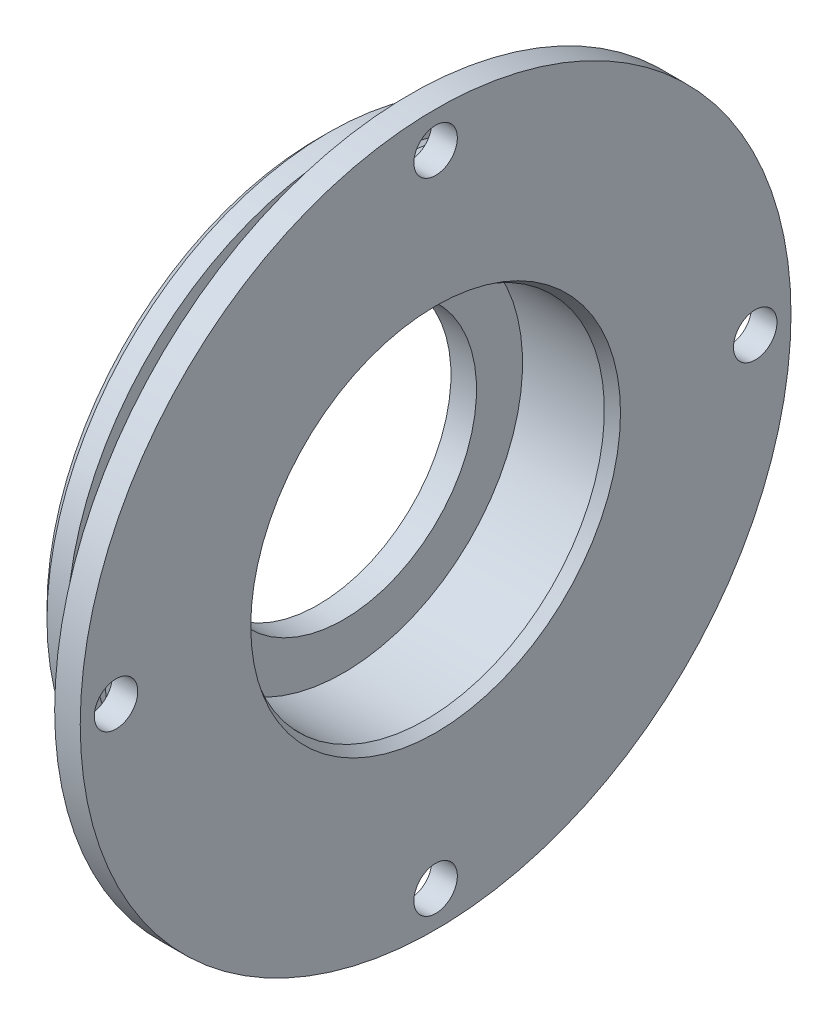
ISO-10303-21;
HEADER;
FILE_DESCRIPTION(('STEP AP214'),'2;1');
FILE_NAME('part.step','',(''),(''),'','','');
FILE_SCHEMA(('AUTOMOTIVE_DESIGN { 1 0 10303 214 1 1 1 1 }'));
ENDSEC;
DATA;
#1=APPLICATION_CONTEXT('core data for automotive mechanical design processes');
#2=APPLICATION_PROTOCOL_DEFINITION('international standard','automotive_design',2000,#1);
#3=PRODUCT_CONTEXT('',#1,'mechanical');
#4=PRODUCT('Part','Part','',(#3));
#5=PRODUCT_RELATED_PRODUCT_CATEGORY('part','',(#4));
#6=PRODUCT_DEFINITION_FORMATION('','',#4);
#7=PRODUCT_DEFINITION_CONTEXT('part definition',#1,'design');
#8=PRODUCT_DEFINITION('design','',#6,#7);
#9=PRODUCT_DEFINITION_SHAPE('','',#8);
#10=(LENGTH_UNIT() NAMED_UNIT(*) SI_UNIT(.MILLI.,.METRE.));
#11=(NAMED_UNIT(*) PLANE_ANGLE_UNIT() SI_UNIT($,.RADIAN.));
#12=(NAMED_UNIT(*) SI_UNIT($,.STERADIAN.) SOLID_ANGLE_UNIT());
#13=UNCERTAINTY_MEASURE_WITH_UNIT(LENGTH_MEASURE(1.E-05),#10,'distance_accuracy_value','');
#14=(GEOMETRIC_REPRESENTATION_CONTEXT(3) GLOBAL_UNCERTAINTY_ASSIGNED_CONTEXT((#13)) GLOBAL_UNIT_ASSIGNED_CONTEXT((#10,
#11,#12)) REPRESENTATION_CONTEXT('',''));
#15=CARTESIAN_POINT('',(0.,0.,0.));
#16=DIRECTION('',(0.,0.,1.));
#17=DIRECTION('',(1.,0.,0.));
#18=AXIS2_PLACEMENT_3D('',#15,#16,#17);
#19=CARTESIAN_POINT('',(-14.8847324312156,0.,0.));
#20=DIRECTION('',(-1.,0.,0.));
#21=DIRECTION('',(0.,0.,1.));
#22=AXIS2_PLACEMENT_3D('',#19,#20,#21);
#23=CYLINDRICAL_SURFACE('',#22,55.);
#24=CARTESIAN_POINT('',(2.,0.,0.));
#25=DIRECTION('',(1.,0.,0.));
#26=DIRECTION('',(0.,0.,-1.));
#27=AXIS2_PLACEMENT_3D('',#24,#25,#26);
#28=CIRCLE('',#27,55.);
#29=CARTESIAN_POINT('',(2.,0.,-55.));
#30=VERTEX_POINT('',#29);
#31=EDGE_CURVE('E462',#30,#30,#28,.T.);
#32=ORIENTED_EDGE('',*,*,#31,.T.);
#33=EDGE_LOOP('',(#32));
#34=FACE_BOUND('',#33,.T.);
#35=CARTESIAN_POINT('',(5.89999999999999,0.,0.));
#36=DIRECTION('',(-1.,0.,0.));
#37=DIRECTION('',(0.,0.,1.));
#38=AXIS2_PLACEMENT_3D('',#35,#36,#37);
#39=CIRCLE('',#38,55.);
#40=CARTESIAN_POINT('',(5.89999999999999,0.,55.));
#41=VERTEX_POINT('',#40);
#42=EDGE_CURVE('E522',#41,#41,#39,.T.);
#43=ORIENTED_EDGE('',*,*,#42,.T.);
#44=EDGE_LOOP('',(#43));
#45=FACE_BOUND('',#44,.T.);
#46=ADVANCED_FACE('F451',(#34,#45),#23,.T.);
#47=CARTESIAN_POINT('',(18.,0.,0.));
#48=DIRECTION('',(-1.,0.,0.));
#49=DIRECTION('',(0.,0.,1.));
#50=AXIS2_PLACEMENT_3D('',#47,#48,#49);
#51=CIRCLE('',#50,55.);
#52=CARTESIAN_POINT('',(18.,0.,55.));
#53=VERTEX_POINT('',#52);
#54=EDGE_CURVE('E474',#53,#53,#51,.T.);
#55=ORIENTED_EDGE('',*,*,#54,.T.);
#56=EDGE_LOOP('',(#55));
#57=FACE_BOUND('',#56,.T.);
#58=CARTESIAN_POINT('',(13.,0.,0.));
#59=DIRECTION('',(-1.,0.,0.));
#60=DIRECTION('',(0.,0.,1.));
#61=AXIS2_PLACEMENT_3D('',#58,#59,#60);
#62=CIRCLE('',#61,55.);
#63=CARTESIAN_POINT('',(13.,0.,55.));
#64=VERTEX_POINT('',#63);
#65=EDGE_CURVE('E519',#64,#64,#62,.T.);
#66=ORIENTED_EDGE('',*,*,#65,.F.);
#67=EDGE_LOOP('',(#66));
#68=FACE_BOUND('',#67,.T.);
#69=ADVANCED_FACE('F544',(#57,#68),#23,.T.);
#70=CARTESIAN_POINT('',(-14.8847324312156,0.,0.));
#71=DIRECTION('',(-1.,0.,0.));
#72=DIRECTION('',(0.,0.,1.));
#73=AXIS2_PLACEMENT_3D('',#70,#71,#72);
#74=CYLINDRICAL_SURFACE('',#73,26.);
#75=CARTESIAN_POINT('',(5.,0.,0.));
#76=DIRECTION('',(-1.,0.,0.));
#77=DIRECTION('',(0.,0.,1.));
#78=AXIS2_PLACEMENT_3D('',#75,#76,#77);
#79=CIRCLE('',#78,26.);
#80=CARTESIAN_POINT('',(5.,0.,26.));
#81=VERTEX_POINT('',#80);
#82=EDGE_CURVE('E486',#81,#81,#79,.T.);
#83=ORIENTED_EDGE('',*,*,#82,.F.);
#84=EDGE_LOOP('',(#83));
#85=FACE_BOUND('',#84,.T.);
#86=CARTESIAN_POINT('',(0.,0.,0.));
#87=DIRECTION('',(-1.,0.,0.));
#88=DIRECTION('',(0.,0.,1.));
#89=AXIS2_PLACEMENT_3D('',#86,#87,#88);
#90=CIRCLE('',#89,26.);
#91=CARTESIAN_POINT('',(0.,0.,26.));
#92=VERTEX_POINT('',#91);
#93=EDGE_CURVE('E471',#92,#92,#90,.T.);
#94=ORIENTED_EDGE('',*,*,#93,.T.);
#95=EDGE_LOOP('',(#94));
#96=FACE_BOUND('',#95,.T.);
#97=ADVANCED_FACE('F453',(#85,#96),#74,.F.);
#98=CARTESIAN_POINT('',(0.,26.,0.));
#99=DIRECTION('',(1.,0.,0.));
#100=DIRECTION('',(0.,0.,-1.));
#101=AXIS2_PLACEMENT_3D('',#98,#99,#100);
#102=PLANE('',#101);
#103=CARTESIAN_POINT('',(0.,0.,0.));
#104=DIRECTION('',(1.,0.,0.));
#105=DIRECTION('',(0.,0.,-1.));
#106=AXIS2_PLACEMENT_3D('',#103,#104,#105);
#107=CIRCLE('',#106,53.);
#108=CARTESIAN_POINT('',(0.,0.,-53.));
#109=VERTEX_POINT('',#108);
#110=EDGE_CURVE('E466',#109,#109,#107,.F.);
#111=ORIENTED_EDGE('',*,*,#110,.T.);
#112=EDGE_LOOP('',(#111));
#113=FACE_BOUND('',#112,.T.);
#114=ORIENTED_EDGE('',*,*,#93,.F.);
#115=EDGE_LOOP('',(#114));
#116=FACE_BOUND('',#115,.T.);
#117=ADVANCED_FACE('F554',(#113,#116),#102,.F.);
#118=CARTESIAN_POINT('',(18.,55.,0.));
#119=DIRECTION('',(1.,0.,0.));
#120=DIRECTION('',(0.,0.,-1.));
#121=AXIS2_PLACEMENT_3D('',#118,#119,#120);
#122=PLANE('',#121);
#123=CARTESIAN_POINT('',(18.,6.54653130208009E-13,-62.5));
#124=DIRECTION('',(1.,0.,0.));
#125=DIRECTION('',(0.,0.,-1.));
#126=AXIS2_PLACEMENT_3D('',#123,#124,#125);
#127=CIRCLE('',#126,4.24999999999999);
#128=CARTESIAN_POINT('',(18.,6.54653130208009E-13,-66.75));
#129=VERTEX_POINT('',#128);
#130=EDGE_CURVE('E507',#129,#129,#127,.T.);
#131=ORIENTED_EDGE('',*,*,#130,.T.);
#132=EDGE_LOOP('',(#131));
#133=FACE_BOUND('',#132,.T.);
#134=CARTESIAN_POINT('',(18.,-62.5,-4.36435420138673E-13));
#135=DIRECTION('',(1.,0.,0.));
#136=DIRECTION('',(0.,0.,-1.));
#137=AXIS2_PLACEMENT_3D('',#134,#135,#136);
#138=CIRCLE('',#137,4.24999999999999);
#139=CARTESIAN_POINT('',(18.,-62.5,-4.25000000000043));
#140=VERTEX_POINT('',#139);
#141=EDGE_CURVE('E501',#140,#140,#138,.T.);
#142=ORIENTED_EDGE('',*,*,#141,.T.);
#143=EDGE_LOOP('',(#142));
#144=FACE_BOUND('',#143,.T.);
#145=CARTESIAN_POINT('',(18.,-2.18217710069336E-13,62.5));
#146=DIRECTION('',(1.,0.,0.));
#147=DIRECTION('',(0.,0.,-1.));
#148=AXIS2_PLACEMENT_3D('',#145,#146,#147);
#149=CIRCLE('',#148,4.24999999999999);
#150=CARTESIAN_POINT('',(18.,-2.18217710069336E-13,58.25));
#151=VERTEX_POINT('',#150);
#152=EDGE_CURVE('E495',#151,#151,#149,.T.);
#153=ORIENTED_EDGE('',*,*,#152,.T.);
#154=EDGE_LOOP('',(#153));
#155=FACE_BOUND('',#154,.T.);
#156=CARTESIAN_POINT('',(18.,62.5,0.));
#157=DIRECTION('',(1.,0.,0.));
#158=DIRECTION('',(0.,0.,-1.));
#159=AXIS2_PLACEMENT_3D('',#156,#157,#158);
#160=CIRCLE('',#159,4.24999999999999);
#161=CARTESIAN_POINT('',(18.,62.5,-4.24999999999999));
#162=VERTEX_POINT('',#161);
#163=EDGE_CURVE('E489',#162,#162,#160,.T.);
#164=ORIENTED_EDGE('',*,*,#163,.T.);
#165=EDGE_LOOP('',(#164));
#166=FACE_BOUND('',#165,.T.);
#167=ORIENTED_EDGE('',*,*,#54,.F.);
#168=EDGE_LOOP('',(#167));
#169=FACE_BOUND('',#168,.T.);
#170=CARTESIAN_POINT('',(18.,0.,0.));
#171=DIRECTION('',(-1.,0.,0.));
#172=DIRECTION('',(0.,0.,1.));
#173=AXIS2_PLACEMENT_3D('',#170,#171,#172);
#174=CIRCLE('',#173,69.5);
#175=CARTESIAN_POINT('',(18.,0.,69.5));
#176=VERTEX_POINT('',#175);
#177=EDGE_CURVE('E477',#176,#176,#174,.T.);
#178=ORIENTED_EDGE('',*,*,#177,.T.);
#179=EDGE_LOOP('',(#178));
#180=FACE_BOUND('',#179,.T.);
#181=ADVANCED_FACE('F552',(#133,#144,#155,#166,#169,#180),#122,.F.);
#182=CARTESIAN_POINT('',(-14.8847324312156,0.,0.));
#183=DIRECTION('',(-1.,0.,0.));
#184=DIRECTION('',(0.,0.,1.));
#185=AXIS2_PLACEMENT_3D('',#182,#183,#184);
#186=CYLINDRICAL_SURFACE('',#185,69.5);
#187=ORIENTED_EDGE('',*,*,#177,.F.);
#188=EDGE_LOOP('',(#187));
#189=FACE_BOUND('',#188,.T.);
#190=CARTESIAN_POINT('',(23.,0.,0.));
#191=DIRECTION('',(-1.,0.,0.));
#192=DIRECTION('',(0.,0.,1.));
#193=AXIS2_PLACEMENT_3D('',#190,#191,#192);
#194=CIRCLE('',#193,69.5);
#195=CARTESIAN_POINT('',(23.,0.,69.5));
#196=VERTEX_POINT('',#195);
#197=EDGE_CURVE('E480',#196,#196,#194,.T.);
#198=ORIENTED_EDGE('',*,*,#197,.T.);
#199=EDGE_LOOP('',(#198));
#200=FACE_BOUND('',#199,.T.);
#201=ADVANCED_FACE('F561',(#189,#200),#186,.T.);
#202=CARTESIAN_POINT('',(23.,69.5,0.));
#203=DIRECTION('',(-1.,0.,0.));
#204=DIRECTION('',(0.,0.,1.));
#205=AXIS2_PLACEMENT_3D('',#202,#203,#204);
#206=PLANE('',#205);
#207=CARTESIAN_POINT('',(23.,0.,0.));
#208=DIRECTION('',(-1.,0.,0.));
#209=DIRECTION('',(0.,0.,1.));
#210=AXIS2_PLACEMENT_3D('',#207,#208,#209);
#211=CIRCLE('',#210,36.1547005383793);
#212=CARTESIAN_POINT('',(23.,0.,36.1547005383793));
#213=VERTEX_POINT('',#212);
#214=EDGE_CURVE('E458',#213,#213,#211,.T.);
#215=ORIENTED_EDGE('',*,*,#214,.T.);
#216=EDGE_LOOP('',(#215));
#217=FACE_BOUND('',#216,.T.);
#218=CARTESIAN_POINT('',(23.,6.54653130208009E-13,-62.5));
#219=DIRECTION('',(1.,0.,0.));
#220=DIRECTION('',(0.,0.,-1.));
#221=AXIS2_PLACEMENT_3D('',#218,#219,#220);
#222=CIRCLE('',#221,4.24999999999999);
#223=CARTESIAN_POINT('',(23.,6.54653130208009E-13,-66.75));
#224=VERTEX_POINT('',#223);
#225=EDGE_CURVE('E510',#224,#224,#222,.T.);
#226=ORIENTED_EDGE('',*,*,#225,.F.);
#227=EDGE_LOOP('',(#226));
#228=FACE_BOUND('',#227,.T.);
#229=CARTESIAN_POINT('',(23.,-62.5,-4.36435420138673E-13));
#230=DIRECTION('',(1.,0.,0.));
#231=DIRECTION('',(0.,0.,-1.));
#232=AXIS2_PLACEMENT_3D('',#229,#230,#231);
#233=CIRCLE('',#232,4.24999999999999);
#234=CARTESIAN_POINT('',(23.,-62.5,-4.25000000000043));
#235=VERTEX_POINT('',#234);
#236=EDGE_CURVE('E504',#235,#235,#233,.T.);
#237=ORIENTED_EDGE('',*,*,#236,.F.);
#238=EDGE_LOOP('',(#237));
#239=FACE_BOUND('',#238,.T.);
#240=CARTESIAN_POINT('',(23.,-2.18217710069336E-13,62.5));
#241=DIRECTION('',(1.,0.,0.));
#242=DIRECTION('',(0.,0.,-1.));
#243=AXIS2_PLACEMENT_3D('',#240,#241,#242);
#244=CIRCLE('',#243,4.24999999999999);
#245=CARTESIAN_POINT('',(23.,-2.18217710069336E-13,58.25));
#246=VERTEX_POINT('',#245);
#247=EDGE_CURVE('E498',#246,#246,#244,.T.);
#248=ORIENTED_EDGE('',*,*,#247,.F.);
#249=EDGE_LOOP('',(#248));
#250=FACE_BOUND('',#249,.T.);
#251=CARTESIAN_POINT('',(23.,62.5,0.));
#252=DIRECTION('',(1.,0.,0.));
#253=DIRECTION('',(0.,0.,-1.));
#254=AXIS2_PLACEMENT_3D('',#251,#252,#253);
#255=CIRCLE('',#254,4.24999999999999);
#256=CARTESIAN_POINT('',(23.,62.5,-4.24999999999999));
#257=VERTEX_POINT('',#256);
#258=EDGE_CURVE('E492',#257,#257,#255,.T.);
#259=ORIENTED_EDGE('',*,*,#258,.F.);
#260=EDGE_LOOP('',(#259));
#261=FACE_BOUND('',#260,.T.);
#262=ORIENTED_EDGE('',*,*,#197,.F.);
#263=EDGE_LOOP('',(#262));
#264=FACE_BOUND('',#263,.T.);
#265=ADVANCED_FACE('F586',(#217,#228,#239,#250,#261,#264),#206,.F.);
#266=CARTESIAN_POINT('',(-14.8847324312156,0.,0.));
#267=DIRECTION('',(-1.,0.,0.));
#268=DIRECTION('',(0.,0.,1.));
#269=AXIS2_PLACEMENT_3D('',#266,#267,#268);
#270=CYLINDRICAL_SURFACE('',#269,35.);
#271=CARTESIAN_POINT('',(21.,0.,0.));
#272=DIRECTION('',(-1.,0.,0.));
#273=DIRECTION('',(0.,0.,1.));
#274=AXIS2_PLACEMENT_3D('',#271,#272,#273);
#275=CIRCLE('',#274,35.);
#276=CARTESIAN_POINT('',(21.,0.,35.));
#277=VERTEX_POINT('',#276);
#278=EDGE_CURVE('E10',#277,#277,#275,.F.);
#279=ORIENTED_EDGE('',*,*,#278,.T.);
#280=EDGE_LOOP('',(#279));
#281=FACE_BOUND('',#280,.T.);
#282=CARTESIAN_POINT('',(5.,0.,0.));
#283=DIRECTION('',(-1.,0.,0.));
#284=DIRECTION('',(0.,0.,1.));
#285=AXIS2_PLACEMENT_3D('',#282,#283,#284);
#286=CIRCLE('',#285,35.);
#287=CARTESIAN_POINT('',(5.,0.,35.));
#288=VERTEX_POINT('',#287);
#289=EDGE_CURVE('E483',#288,#288,#286,.T.);
#290=ORIENTED_EDGE('',*,*,#289,.T.);
#291=EDGE_LOOP('',(#290));
#292=FACE_BOUND('',#291,.T.);
#293=ADVANCED_FACE('F576',(#281,#292),#270,.F.);
#294=CARTESIAN_POINT('',(5.,35.,0.));
#295=DIRECTION('',(-1.,0.,0.));
#296=DIRECTION('',(0.,0.,1.));
#297=AXIS2_PLACEMENT_3D('',#294,#295,#296);
#298=PLANE('',#297);
#299=ORIENTED_EDGE('',*,*,#289,.F.);
#300=EDGE_LOOP('',(#299));
#301=FACE_BOUND('',#300,.T.);
#302=ORIENTED_EDGE('',*,*,#82,.T.);
#303=EDGE_LOOP('',(#302));
#304=FACE_BOUND('',#303,.T.);
#305=ADVANCED_FACE('F573',(#301,#304),#298,.F.);
#306=CARTESIAN_POINT('',(23.,62.5,0.));
#307=DIRECTION('',(1.,0.,0.));
#308=DIRECTION('',(0.,0.,-1.));
#309=AXIS2_PLACEMENT_3D('',#306,#307,#308);
#310=CYLINDRICAL_SURFACE('',#309,4.24999999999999);
#311=ORIENTED_EDGE('',*,*,#258,.T.);
#312=EDGE_LOOP('',(#311));
#313=FACE_BOUND('',#312,.T.);
#314=ORIENTED_EDGE('',*,*,#163,.F.);
#315=EDGE_LOOP('',(#314));
#316=FACE_BOUND('',#315,.T.);
#317=ADVANCED_FACE('F575',(#313,#316),#310,.F.);
#318=CARTESIAN_POINT('',(23.,-2.18217710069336E-13,62.5));
#319=DIRECTION('',(1.,0.,0.));
#320=DIRECTION('',(0.,0.,-1.));
#321=AXIS2_PLACEMENT_3D('',#318,#319,#320);
#322=CYLINDRICAL_SURFACE('',#321,4.24999999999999);
#323=ORIENTED_EDGE('',*,*,#247,.T.);
#324=EDGE_LOOP('',(#323));
#325=FACE_BOUND('',#324,.T.);
#326=ORIENTED_EDGE('',*,*,#152,.F.);
#327=EDGE_LOOP('',(#326));
#328=FACE_BOUND('',#327,.T.);
#329=ADVANCED_FACE('F583',(#325,#328),#322,.F.);
#330=CARTESIAN_POINT('',(23.,-62.5,-4.36435420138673E-13));
#331=DIRECTION('',(1.,0.,0.));
#332=DIRECTION('',(0.,0.,-1.));
#333=AXIS2_PLACEMENT_3D('',#330,#331,#332);
#334=CYLINDRICAL_SURFACE('',#333,4.24999999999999);
#335=ORIENTED_EDGE('',*,*,#236,.T.);
#336=EDGE_LOOP('',(#335));
#337=FACE_BOUND('',#336,.T.);
#338=ORIENTED_EDGE('',*,*,#141,.F.);
#339=EDGE_LOOP('',(#338));
#340=FACE_BOUND('',#339,.T.);
#341=ADVANCED_FACE('F624',(#337,#340),#334,.F.);
#342=CARTESIAN_POINT('',(23.,6.54653130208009E-13,-62.5));
#343=DIRECTION('',(1.,0.,0.));
#344=DIRECTION('',(0.,0.,-1.));
#345=AXIS2_PLACEMENT_3D('',#342,#343,#344);
#346=CYLINDRICAL_SURFACE('',#345,4.24999999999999);
#347=ORIENTED_EDGE('',*,*,#225,.T.);
#348=EDGE_LOOP('',(#347));
#349=FACE_BOUND('',#348,.T.);
#350=ORIENTED_EDGE('',*,*,#130,.F.);
#351=EDGE_LOOP('',(#350));
#352=FACE_BOUND('',#351,.T.);
#353=ADVANCED_FACE('F540',(#349,#352),#346,.F.);
#354=CARTESIAN_POINT('',(0.,0.,0.));
#355=DIRECTION('',(1.,0.,0.));
#356=DIRECTION('',(0.,0.,-1.));
#357=AXIS2_PLACEMENT_3D('',#354,#355,#356);
#358=CONICAL_SURFACE('',#357,53.,0.785398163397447);
#359=ORIENTED_EDGE('',*,*,#31,.F.);
#360=EDGE_LOOP('',(#359));
#361=FACE_BOUND('',#360,.T.);
#362=ORIENTED_EDGE('',*,*,#110,.F.);
#363=EDGE_LOOP('',(#362));
#364=FACE_BOUND('',#363,.T.);
#365=ADVANCED_FACE('F530',(#361,#364),#358,.T.);
#366=CARTESIAN_POINT('',(5.90000000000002,55.,0.));
#367=DIRECTION('',(1.,0.,0.));
#368=DIRECTION('',(0.,0.,-1.));
#369=AXIS2_PLACEMENT_3D('',#366,#367,#368);
#370=PLANE('',#369);
#371=CARTESIAN_POINT('',(5.89999999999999,0.,0.));
#372=DIRECTION('',(-1.,0.,0.));
#373=DIRECTION('',(0.,0.,1.));
#374=AXIS2_PLACEMENT_3D('',#371,#372,#373);
#375=CIRCLE('',#374,50.65);
#376=CARTESIAN_POINT('',(5.89999999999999,0.,50.65));
#377=VERTEX_POINT('',#376);
#378=EDGE_CURVE('E513',#377,#377,#375,.T.);
#379=ORIENTED_EDGE('',*,*,#378,.T.);
#380=EDGE_LOOP('',(#379));
#381=FACE_BOUND('',#380,.T.);
#382=ORIENTED_EDGE('',*,*,#42,.F.);
#383=EDGE_LOOP('',(#382));
#384=FACE_BOUND('',#383,.T.);
#385=ADVANCED_FACE('F527',(#381,#384),#370,.T.);
#386=CARTESIAN_POINT('',(-11.9747690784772,0.,0.));
#387=DIRECTION('',(-1.,0.,0.));
#388=DIRECTION('',(0.,0.,1.));
#389=AXIS2_PLACEMENT_3D('',#386,#387,#388);
#390=CYLINDRICAL_SURFACE('',#389,50.65);
#391=CARTESIAN_POINT('',(13.,0.,0.));
#392=DIRECTION('',(-1.,0.,0.));
#393=DIRECTION('',(0.,0.,1.));
#394=AXIS2_PLACEMENT_3D('',#391,#392,#393);
#395=CIRCLE('',#394,50.65);
#396=CARTESIAN_POINT('',(13.,0.,50.65));
#397=VERTEX_POINT('',#396);
#398=EDGE_CURVE('E516',#397,#397,#395,.T.);
#399=ORIENTED_EDGE('',*,*,#398,.T.);
#400=EDGE_LOOP('',(#399));
#401=FACE_BOUND('',#400,.T.);
#402=ORIENTED_EDGE('',*,*,#378,.F.);
#403=EDGE_LOOP('',(#402));
#404=FACE_BOUND('',#403,.T.);
#405=ADVANCED_FACE('F529',(#401,#404),#390,.T.);
#406=CARTESIAN_POINT('',(13.,55.,0.));
#407=DIRECTION('',(-1.,0.,0.));
#408=DIRECTION('',(0.,0.,1.));
#409=AXIS2_PLACEMENT_3D('',#406,#407,#408);
#410=PLANE('',#409);
#411=ORIENTED_EDGE('',*,*,#65,.T.);
#412=EDGE_LOOP('',(#411));
#413=FACE_BOUND('',#412,.T.);
#414=ORIENTED_EDGE('',*,*,#398,.F.);
#415=EDGE_LOOP('',(#414));
#416=FACE_BOUND('',#415,.T.);
#417=ADVANCED_FACE('F537',(#413,#416),#410,.T.);
#418=CARTESIAN_POINT('',(23.,0.,0.));
#419=DIRECTION('',(1.,0.,0.));
#420=DIRECTION('',(0.,0.,-1.));
#421=AXIS2_PLACEMENT_3D('',#418,#419,#420);
#422=CONICAL_SURFACE('',#421,36.1547005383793,0.523598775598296);
#423=ORIENTED_EDGE('',*,*,#278,.F.);
#424=EDGE_LOOP('',(#423));
#425=FACE_BOUND('',#424,.T.);
#426=ORIENTED_EDGE('',*,*,#214,.F.);
#427=EDGE_LOOP('',(#426));
#428=FACE_BOUND('',#427,.T.);
#429=ADVANCED_FACE('F661',(#425,#428),#422,.F.);
#430=CLOSED_SHELL('',(#46,#69,#97,#117,#181,#201,#265,#293,#305,#317,#329,#341,#353,#365,#385,
#405,#417,#429));
#431=MANIFOLD_SOLID_BREP('B2',#430);
#432=ADVANCED_BREP_SHAPE_REPRESENTATION('',(#18,#431),#14);
#433=SHAPE_DEFINITION_REPRESENTATION(#9,#432);
ENDSEC;
END-ISO-10303-21;
